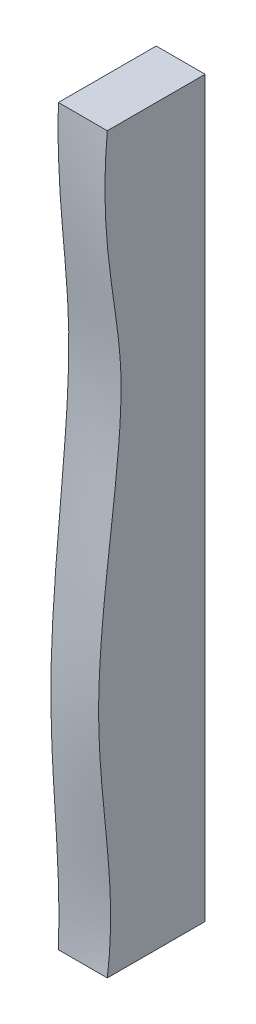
ISO-10303-21;
HEADER;
FILE_DESCRIPTION(('STEP AP214'),'2;1');
FILE_NAME('part.step','',(''),(''),'','','');
FILE_SCHEMA(('AUTOMOTIVE_DESIGN { 1 0 10303 214 1 1 1 1 }'));
ENDSEC;
DATA;
#1=APPLICATION_CONTEXT('core data for automotive mechanical design processes');
#2=APPLICATION_PROTOCOL_DEFINITION('international standard','automotive_design',2000,#1);
#3=PRODUCT_CONTEXT('',#1,'mechanical');
#4=PRODUCT('Part','Part','',(#3));
#5=PRODUCT_RELATED_PRODUCT_CATEGORY('part','',(#4));
#6=PRODUCT_DEFINITION_FORMATION('','',#4);
#7=PRODUCT_DEFINITION_CONTEXT('part definition',#1,'design');
#8=PRODUCT_DEFINITION('design','',#6,#7);
#9=PRODUCT_DEFINITION_SHAPE('','',#8);
#10=(LENGTH_UNIT() NAMED_UNIT(*) SI_UNIT(.MILLI.,.METRE.));
#11=(NAMED_UNIT(*) PLANE_ANGLE_UNIT() SI_UNIT($,.RADIAN.));
#12=(NAMED_UNIT(*) SI_UNIT($,.STERADIAN.) SOLID_ANGLE_UNIT());
#13=UNCERTAINTY_MEASURE_WITH_UNIT(LENGTH_MEASURE(1.E-05),#10,'distance_accuracy_value','');
#14=(GEOMETRIC_REPRESENTATION_CONTEXT(3) GLOBAL_UNCERTAINTY_ASSIGNED_CONTEXT((#13)) GLOBAL_UNIT_ASSIGNED_CONTEXT((#10,
#11,#12)) REPRESENTATION_CONTEXT('',''));
#15=CARTESIAN_POINT('',(0.,0.,0.));
#16=DIRECTION('',(0.,0.,1.));
#17=DIRECTION('',(1.,0.,0.));
#18=AXIS2_PLACEMENT_3D('',#15,#16,#17);
#19=CARTESIAN_POINT('',(-750.,-375.,253.111113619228));
#20=DIRECTION('',(0.,1.,0.));
#21=DIRECTION('',(0.,0.,1.));
#22=AXIS2_PLACEMENT_3D('',#19,#20,#21);
#23=PLANE('',#22);
#24=DIRECTION('',(0.,0.,-1.));
#25=VECTOR('',#24,1.);
#26=CARTESIAN_POINT('',(-650.,-375.,253.120113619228));
#27=LINE('',#26,#25);
#28=CARTESIAN_POINT('',(-650.,-375.,100.));
#29=VERTEX_POINT('',#28);
#30=CARTESIAN_POINT('',(-650.,-375.,0.));
#31=VERTEX_POINT('',#30);
#32=EDGE_CURVE('E11',#29,#31,#27,.T.);
#33=ORIENTED_EDGE('',*,*,#32,.F.);
#34=CARTESIAN_POINT('',(-750.,-375.,100.));
#35=CARTESIAN_POINT('',(-644.685568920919,-375.,100.));
#36=CARTESIAN_POINT('',(-536.684515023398,-375.,100.));
#37=CARTESIAN_POINT('',(-355.235514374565,-375.,100.));
#38=CARTESIAN_POINT('',(-175.903454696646,-375.,100.));
#39=CARTESIAN_POINT('',(47.4554331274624,-375.,100.));
#40=CARTESIAN_POINT('',(285.091607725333,-375.,100.));
#41=CARTESIAN_POINT('',(500.445116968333,-375.,100.));
#42=CARTESIAN_POINT('',(669.085175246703,-375.,100.));
#43=CARTESIAN_POINT('',(750.,-375.,100.));
#44=B_SPLINE_CURVE_WITH_KNOTS('',3,(#34,#35,#36,#37,#38,#39,#40,#41,#42,#43),.UNSPECIFIED.,.F.,
.F.,(4,1,1,1,1,1,1,4),(0.,0.210628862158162,0.216002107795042,0.362898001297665,0.569292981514,
0.66271988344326,0.838170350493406,1.),.UNSPECIFIED.);
#45=CARTESIAN_POINT('',(-700.,-375.,100.));
#46=VERTEX_POINT('',#45);
#47=EDGE_CURVE('E165',#46,#29,#44,.T.);
#48=ORIENTED_EDGE('',*,*,#47,.F.);
#49=DIRECTION('',(0.,0.,-1.));
#50=VECTOR('',#49,1.);
#51=CARTESIAN_POINT('',(-700.,-375.,253.120113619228));
#52=LINE('',#51,#50);
#53=CARTESIAN_POINT('',(-700.,-375.,0.));
#54=VERTEX_POINT('',#53);
#55=EDGE_CURVE('E89',#46,#54,#52,.T.);
#56=ORIENTED_EDGE('',*,*,#55,.T.);
#57=DIRECTION('',(1.,0.,0.));
#58=VECTOR('',#57,1.);
#59=CARTESIAN_POINT('',(-750.,-375.,0.));
#60=LINE('',#59,#58);
#61=EDGE_CURVE('E84',#54,#31,#60,.T.);
#62=ORIENTED_EDGE('',*,*,#61,.T.);
#63=EDGE_LOOP('',(#33,#48,#56,#62));
#64=FACE_BOUND('',#63,.T.);
#65=ADVANCED_FACE('F35',(#64),#23,.F.);
#66=CARTESIAN_POINT('',(-750.,375.,253.111113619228));
#67=DIRECTION('',(0.,-1.,0.));
#68=DIRECTION('',(0.,0.,-1.));
#69=AXIS2_PLACEMENT_3D('',#66,#67,#68);
#70=PLANE('',#69);
#71=DIRECTION('',(0.,0.,-1.));
#72=VECTOR('',#71,1.);
#73=CARTESIAN_POINT('',(-650.,375.,253.120113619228));
#74=LINE('',#73,#72);
#75=CARTESIAN_POINT('',(-650.,375.,100.));
#76=VERTEX_POINT('',#75);
#77=CARTESIAN_POINT('',(-650.,375.,0.));
#78=VERTEX_POINT('',#77);
#79=EDGE_CURVE('E54',#76,#78,#74,.T.);
#80=ORIENTED_EDGE('',*,*,#79,.T.);
#81=DIRECTION('',(-1.,0.,0.));
#82=VECTOR('',#81,1.);
#83=CARTESIAN_POINT('',(-750.,375.,0.));
#84=LINE('',#83,#82);
#85=CARTESIAN_POINT('',(-700.,375.,0.));
#86=VERTEX_POINT('',#85);
#87=EDGE_CURVE('E85',#78,#86,#84,.T.);
#88=ORIENTED_EDGE('',*,*,#87,.T.);
#89=DIRECTION('',(0.,0.,-1.));
#90=VECTOR('',#89,1.);
#91=CARTESIAN_POINT('',(-700.,375.,253.120113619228));
#92=LINE('',#91,#90);
#93=CARTESIAN_POINT('',(-700.,375.,100.));
#94=VERTEX_POINT('',#93);
#95=EDGE_CURVE('E162',#94,#86,#92,.T.);
#96=ORIENTED_EDGE('',*,*,#95,.F.);
#97=CARTESIAN_POINT('',(750.,375.,100.));
#98=CARTESIAN_POINT('',(669.085175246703,375.,100.));
#99=CARTESIAN_POINT('',(500.445116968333,375.,100.));
#100=CARTESIAN_POINT('',(285.091607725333,375.,100.));
#101=CARTESIAN_POINT('',(47.4554331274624,375.,100.));
#102=CARTESIAN_POINT('',(-175.903454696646,375.,100.));
#103=CARTESIAN_POINT('',(-355.235514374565,375.,100.));
#104=CARTESIAN_POINT('',(-536.684515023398,375.,100.));
#105=CARTESIAN_POINT('',(-644.685568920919,375.,100.));
#106=CARTESIAN_POINT('',(-750.,375.,100.));
#107=B_SPLINE_CURVE_WITH_KNOTS('',3,(#97,#98,#99,#100,#101,#102,#103,#104,#105,#106),
.UNSPECIFIED.,.F.,.F.,(4,1,1,1,1,1,1,4),(0.,0.161829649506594,0.33728011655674,0.430707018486,
0.637101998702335,0.783997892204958,0.789371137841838,1.),.UNSPECIFIED.);
#108=EDGE_CURVE('E161',#76,#94,#107,.T.);
#109=ORIENTED_EDGE('',*,*,#108,.F.);
#110=EDGE_LOOP('',(#80,#88,#96,#109));
#111=FACE_BOUND('',#110,.T.);
#112=ADVANCED_FACE('F116',(#111),#70,.F.);
#113=CARTESIAN_POINT('',(0.,0.,0.));
#114=DIRECTION('',(0.,0.,-1.));
#115=DIRECTION('',(-1.,0.,0.));
#116=AXIS2_PLACEMENT_3D('',#113,#114,#115);
#117=PLANE('',#116);
#118=ORIENTED_EDGE('',*,*,#87,.F.);
#119=DIRECTION('',(0.,-1.,0.));
#120=VECTOR('',#119,1.);
#121=CARTESIAN_POINT('',(-650.,375.,0.));
#122=LINE('',#121,#120);
#123=EDGE_CURVE('E74',#78,#31,#122,.T.);
#124=ORIENTED_EDGE('',*,*,#123,.T.);
#125=ORIENTED_EDGE('',*,*,#61,.F.);
#126=DIRECTION('',(0.,1.,0.));
#127=VECTOR('',#126,1.);
#128=CARTESIAN_POINT('',(-700.,375.,0.));
#129=LINE('',#128,#127);
#130=EDGE_CURVE('E86',#54,#86,#129,.T.);
#131=ORIENTED_EDGE('',*,*,#130,.T.);
#132=EDGE_LOOP('',(#118,#124,#125,#131));
#133=FACE_BOUND('',#132,.T.);
#134=ADVANCED_FACE('F82',(#133),#117,.T.);
#135=CARTESIAN_POINT('',(750.,-375.,100.));
#136=CARTESIAN_POINT('',(750.,-302.078506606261,100.));
#137=CARTESIAN_POINT('',(750.,-224.483786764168,100.));
#138=CARTESIAN_POINT('',(750.,-61.5160152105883,100.));
#139=CARTESIAN_POINT('',(750.,39.4445673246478,100.));
#140=CARTESIAN_POINT('',(750.,211.849847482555,100.));
#141=CARTESIAN_POINT('',(750.,298.882075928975,100.));
#142=CARTESIAN_POINT('',(750.,375.,100.));
#143=CARTESIAN_POINT('',(669.085175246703,-375.,100.));
#144=CARTESIAN_POINT('',(669.085175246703,-302.078506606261,100.));
#145=CARTESIAN_POINT('',(669.085175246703,-234.282472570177,121.198481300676));
#146=CARTESIAN_POINT('',(669.085175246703,-62.2283080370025,120.288550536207));
#147=CARTESIAN_POINT('',(669.085175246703,68.0647781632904,82.7868169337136));
#148=CARTESIAN_POINT('',(669.085175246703,240.312514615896,73.0426687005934));
#149=CARTESIAN_POINT('',(669.085175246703,298.882075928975,100.));
#150=CARTESIAN_POINT('',(669.085175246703,375.,100.));
#151=CARTESIAN_POINT('',(500.445116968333,-375.,100.));
#152=CARTESIAN_POINT('',(517.991528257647,-284.627602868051,95.5040591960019));
#153=CARTESIAN_POINT('',(530.038001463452,-221.673003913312,150.719602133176));
#154=CARTESIAN_POINT('',(473.74510655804,-71.7416270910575,167.060530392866));
#155=CARTESIAN_POINT('',(387.213321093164,45.6135081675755,91.591323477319));
#156=CARTESIAN_POINT('',(378.694107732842,207.638743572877,66.6461848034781));
#157=CARTESIAN_POINT('',(433.17831170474,253.396603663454,122.492891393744));
#158=CARTESIAN_POINT('',(500.445116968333,375.,100.));
#159=CARTESIAN_POINT('',(285.091607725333,-375.,100.));
#160=CARTESIAN_POINT('',(309.270321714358,-264.297524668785,86.4064578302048));
#161=CARTESIAN_POINT('',(325.856840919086,-200.08226970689,164.07204721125));
#162=CARTESIAN_POINT('',(247.47112957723,-80.9425320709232,234.992870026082));
#163=CARTESIAN_POINT('',(127.240382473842,2.40271344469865,186.756001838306));
#164=CARTESIAN_POINT('',(115.567806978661,152.518027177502,151.057444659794));
#165=CARTESIAN_POINT('',(191.428893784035,202.025100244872,189.039851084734));
#166=CARTESIAN_POINT('',(285.091607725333,375.,100.));
#167=CARTESIAN_POINT('',(47.4554331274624,-375.,100.));
#168=CARTESIAN_POINT('',(51.0669239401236,-278.639867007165,99.5141662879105));
#169=CARTESIAN_POINT('',(52.9210710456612,-231.452124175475,201.325948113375));
#170=CARTESIAN_POINT('',(3.18149891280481,-90.8615864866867,272.445475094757));
#171=CARTESIAN_POINT('',(-61.0346058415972,45.7948958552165,186.157760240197));
#172=CARTESIAN_POINT('',(-59.6612105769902,205.286893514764,133.941969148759));
#173=CARTESIAN_POINT('',(-11.8049718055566,220.40073671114,189.8209162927));
#174=CARTESIAN_POINT('',(47.4554331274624,375.,100.));
#175=CARTESIAN_POINT('',(-175.903454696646,-375.,100.));
#176=CARTESIAN_POINT('',(-199.823715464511,-320.588060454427,126.731848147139));
#177=CARTESIAN_POINT('',(-216.967937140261,-300.821135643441,242.921959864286));
#178=CARTESIAN_POINT('',(-184.265304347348,-55.1410097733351,206.147478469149));
#179=CARTESIAN_POINT('',(-119.865061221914,249.096629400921,-32.5779079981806));
#180=CARTESIAN_POINT('',(-104.641938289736,431.262460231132,-94.4845569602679));
#181=CARTESIAN_POINT('',(-136.623034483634,348.137040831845,60.785640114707));
#182=CARTESIAN_POINT('',(-175.903454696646,375.,100.));
#183=CARTESIAN_POINT('',(-355.235514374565,-375.,100.));
#184=CARTESIAN_POINT('',(-319.200833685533,-282.590755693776,58.2859511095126));
#185=CARTESIAN_POINT('',(-293.075279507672,-226.888141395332,104.97090627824));
#186=CARTESIAN_POINT('',(-324.119079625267,-68.6572837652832,122.102733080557));
#187=CARTESIAN_POINT('',(-398.972481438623,73.039345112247,53.3701087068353));
#188=CARTESIAN_POINT('',(-423.398679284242,233.384819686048,47.4380317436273));
#189=CARTESIAN_POINT('',(-392.720188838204,253.575952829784,124.952096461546));
#190=CARTESIAN_POINT('',(-355.235514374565,375.,100.));
#191=CARTESIAN_POINT('',(-536.684515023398,-375.,100.));
#192=CARTESIAN_POINT('',(-494.827225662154,-277.129657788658,52.0422385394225));
#193=CARTESIAN_POINT('',(-464.573647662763,-205.017596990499,67.039018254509));
#194=CARTESIAN_POINT('',(-506.334367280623,-72.2467511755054,96.5036749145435));
#195=CARTESIAN_POINT('',(-600.216684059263,9.35641022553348,95.9941925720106));
#196=CARTESIAN_POINT('',(-628.122542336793,166.946160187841,106.349064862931));
#197=CARTESIAN_POINT('',(-587.011939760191,237.095914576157,138.331902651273));
#198=CARTESIAN_POINT('',(-536.684515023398,375.,100.));
#199=CARTESIAN_POINT('',(-644.685568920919,-375.,100.));
#200=CARTESIAN_POINT('',(-644.685568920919,-302.078506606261,100.));
#201=CARTESIAN_POINT('',(-644.685568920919,-237.237234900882,127.59081546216));
#202=CARTESIAN_POINT('',(-644.685568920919,-62.4430976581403,126.406497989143));
#203=CARTESIAN_POINT('',(-644.685568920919,76.6951111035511,77.5962366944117));
#204=CARTESIAN_POINT('',(-644.685568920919,248.895340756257,64.9137717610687));
#205=CARTESIAN_POINT('',(-644.685568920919,298.882075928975,100.));
#206=CARTESIAN_POINT('',(-644.685568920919,375.,100.));
#207=CARTESIAN_POINT('',(-750.,-375.,100.));
#208=CARTESIAN_POINT('',(-750.,-302.078506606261,100.));
#209=CARTESIAN_POINT('',(-750.,-224.483786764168,100.));
#210=CARTESIAN_POINT('',(-750.,-61.5160152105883,100.));
#211=CARTESIAN_POINT('',(-750.,39.4445673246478,100.));
#212=CARTESIAN_POINT('',(-750.,211.849847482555,100.));
#213=CARTESIAN_POINT('',(-750.,298.882075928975,100.));
#214=CARTESIAN_POINT('',(-750.,375.,100.));
#215=B_SPLINE_SURFACE_WITH_KNOTS('',3,3,((#135,#136,#137,#138,#139,#140,#141,#142),(#143,#144,
#145,#146,#147,#148,#149,#150),(#151,#152,#153,#154,#155,#156,#157,#158),(#159,#160,#161,#162,
#163,#164,#165,#166),(#167,#168,#169,#170,#171,#172,#173,#174),(#175,#176,#177,#178,#179,#180,
#181,#182),(#183,#184,#185,#186,#187,#188,#189,#190),(#191,#192,#193,#194,#195,#196,#197,#198),
(#199,#200,#201,#202,#203,#204,#205,#206),(#207,#208,#209,#210,#211,#212,#213,#214)),
.UNSPECIFIED.,.F.,.F.,.F.,(4,1,1,1,1,1,1,4),(4,1,1,1,1,4),(0.,0.161829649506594,
0.33728011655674,0.430707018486,0.637101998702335,0.783997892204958,0.789371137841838,1.),(0.,
0.291685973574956,0.310378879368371,0.65187108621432,0.695528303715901,1.),.UNSPECIFIED.);
#216=CARTESIAN_POINT('',(-650.,375.,100.));
#217=CARTESIAN_POINT('',(-650.,372.29131660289,100.259982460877));
#218=CARTESIAN_POINT('',(-650.,369.580709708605,100.500061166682));
#219=CARTESIAN_POINT('',(-650.,364.156408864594,100.939560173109));
#220=CARTESIAN_POINT('',(-650.,361.442715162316,101.138983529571));
#221=CARTESIAN_POINT('',(-650.,356.0127964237,101.496346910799));
#222=CARTESIAN_POINT('',(-650.,353.296571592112,101.654290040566));
#223=CARTESIAN_POINT('',(-650.,347.862165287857,101.928024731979));
#224=CARTESIAN_POINT('',(-650.,345.143983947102,102.043818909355));
#225=CARTESIAN_POINT('',(-650.,339.706244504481,102.232738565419));
#226=CARTESIAN_POINT('',(-650.,336.986686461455,102.305865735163));
#227=CARTESIAN_POINT('',(-650.,331.546784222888,102.409127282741));
#228=CARTESIAN_POINT('',(-650.,328.826440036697,102.439262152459));
#229=CARTESIAN_POINT('',(-650.,323.398434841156,102.456403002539));
#230=CARTESIAN_POINT('',(-650.,320.690774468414,102.443611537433));
#231=CARTESIAN_POINT('',(-650.,315.276004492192,102.375521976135));
#232=CARTESIAN_POINT('',(-650.,312.568894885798,102.32022411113));
#233=CARTESIAN_POINT('',(-650.,307.155870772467,102.167615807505));
#234=CARTESIAN_POINT('',(-650.,304.449956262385,102.070305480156));
#235=CARTESIAN_POINT('',(-650.,299.039950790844,101.834532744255));
#236=CARTESIAN_POINT('',(-650.,296.335859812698,101.696070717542));
#237=CARTESIAN_POINT('',(-650.,290.930113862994,101.379278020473));
#238=CARTESIAN_POINT('',(-650.,288.228458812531,101.200948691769));
#239=CARTESIAN_POINT('',(-650.,282.828170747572,100.806180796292));
#240=CARTESIAN_POINT('',(-650.,280.129537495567,100.58974547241));
#241=CARTESIAN_POINT('',(-650.,275.414941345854,100.180089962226));
#242=CARTESIAN_POINT('',(-650.,273.398287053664,99.9947599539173));
#243=CARTESIAN_POINT('',(-650.,269.36690755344,99.6052325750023));
#244=CARTESIAN_POINT('',(-650.,267.352182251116,99.4010361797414));
#245=CARTESIAN_POINT('',(-650.,263.324634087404,98.9751303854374));
#246=CARTESIAN_POINT('',(-650.,261.311811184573,98.7534213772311));
#247=CARTESIAN_POINT('',(-650.,257.288013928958,98.2940565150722));
#248=CARTESIAN_POINT('',(-650.,255.277039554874,98.0564008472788));
#249=CARTESIAN_POINT('',(-650.,251.25609579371,97.5668374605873));
#250=CARTESIAN_POINT('',(-650.,249.246127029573,97.3149246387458));
#251=CARTESIAN_POINT('',(-650.,245.227745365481,96.7989396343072));
#252=CARTESIAN_POINT('',(-650.,243.219332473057,96.5348673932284));
#253=CARTESIAN_POINT('',(-650.,239.203816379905,95.9968139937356));
#254=CARTESIAN_POINT('',(-650.,237.196713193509,95.7228327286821));
#255=CARTESIAN_POINT('',(-650.,233.183537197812,95.1674572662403));
#256=CARTESIAN_POINT('',(-650.,231.177464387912,94.8860630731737));
#257=CARTESIAN_POINT('',(-650.,227.167507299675,94.318811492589));
#258=CARTESIAN_POINT('',(-650.,225.163622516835,94.0329576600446));
#259=CARTESIAN_POINT('',(-650.,221.156113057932,93.4595443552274));
#260=CARTESIAN_POINT('',(-650.,219.152488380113,93.1719848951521));
#261=CARTESIAN_POINT('',(-650.,215.145205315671,92.5983697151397));
#262=CARTESIAN_POINT('',(-650.,213.141546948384,92.3123138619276));
#263=CARTESIAN_POINT('',(-650.,209.133541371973,91.7450741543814));
#264=CARTESIAN_POINT('',(-650.,207.129194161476,91.4638903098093));
#265=CARTESIAN_POINT('',(-650.,201.113782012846,90.6328786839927));
#266=CARTESIAN_POINT('',(-650.,197.100922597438,90.0956753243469));
#267=CARTESIAN_POINT('',(-650.,191.075501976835,89.3375107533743));
#268=CARTESIAN_POINT('',(-650.,189.065951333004,89.0927232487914));
#269=CARTESIAN_POINT('',(-650.,185.044539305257,88.6228341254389));
#270=CARTESIAN_POINT('',(-650.,183.032677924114,88.3977324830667));
#271=CARTESIAN_POINT('',(-650.,179.005657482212,87.9708421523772));
#272=CARTESIAN_POINT('',(-650.,176.990497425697,87.7690628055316));
#273=CARTESIAN_POINT('',(-650.,172.95763487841,87.39249260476));
#274=CARTESIAN_POINT('',(-650.,170.939932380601,87.2177018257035));
#275=CARTESIAN_POINT('',(-650.,166.902229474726,86.8984497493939));
#276=CARTESIAN_POINT('',(-650.,164.882229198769,86.7539867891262));
#277=CARTESIAN_POINT('',(-650.,160.840105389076,86.4983871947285));
#278=CARTESIAN_POINT('',(-650.,158.817981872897,86.3872502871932));
#279=CARTESIAN_POINT('',(-650.,156.120512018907,86.2630069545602));
#280=CARTESIAN_POINT('',(-650.,155.445878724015,86.2339352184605));
#281=CARTESIAN_POINT('',(-650.,154.096448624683,86.1798641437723));
#282=CARTESIAN_POINT('',(-650.,153.421651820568,86.1548647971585));
#283=CARTESIAN_POINT('',(-650.,152.071913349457,86.1090327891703));
#284=CARTESIAN_POINT('',(-650.,151.396971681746,86.0882001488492));
#285=CARTESIAN_POINT('',(-650.,150.046972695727,86.0507153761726));
#286=CARTESIAN_POINT('',(-650.,149.371915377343,86.0340632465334));
#287=CARTESIAN_POINT('',(-650.,147.346618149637,85.9901308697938));
#288=CARTESIAN_POINT('',(-650.,145.996243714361,85.9688743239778));
#289=CARTESIAN_POINT('',(-650.,143.295505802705,85.9413333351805));
#290=CARTESIAN_POINT('',(-650.,141.945142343,85.9350471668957));
#291=CARTESIAN_POINT('',(-650.,139.244421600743,85.9363774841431));
#292=CARTESIAN_POINT('',(-650.,137.894064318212,85.9439940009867));
#293=CARTESIAN_POINT('',(-650.,135.1934889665,85.972116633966));
#294=CARTESIAN_POINT('',(-650.,133.843270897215,85.9926227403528));
#295=CARTESIAN_POINT('',(-650.,130.871758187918,86.0508713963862));
#296=CARTESIAN_POINT('',(-650.,129.250515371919,86.0912496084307));
#297=CARTESIAN_POINT('',(-650.,126.008482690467,86.1875922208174));
#298=CARTESIAN_POINT('',(-650.,124.387692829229,86.2435567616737));
#299=CARTESIAN_POINT('',(-650.,121.956845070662,86.3380607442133));
#300=CARTESIAN_POINT('',(-650.,121.146577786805,86.3713235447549));
#301=CARTESIAN_POINT('',(-650.,119.526186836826,86.4411827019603));
#302=CARTESIAN_POINT('',(-650.,118.716063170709,86.4777790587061));
#303=CARTESIAN_POINT('',(-650.,116.285926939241,86.5924121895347));
#304=CARTESIAN_POINT('',(-650.,114.666140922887,86.6752933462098));
#305=CARTESIAN_POINT('',(-650.,111.426985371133,86.8532037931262));
#306=CARTESIAN_POINT('',(-650.,109.807615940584,86.9482349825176));
#307=CARTESIAN_POINT('',(-650.,106.569585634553,87.1496532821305));
#308=CARTESIAN_POINT('',(-650.,104.950924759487,87.2560403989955));
#309=CARTESIAN_POINT('',(-650.,100.095710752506,87.5910964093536));
#310=CARTESIAN_POINT('',(-650.,96.8602456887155,87.8356421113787));
#311=CARTESIAN_POINT('',(-650.,90.3923648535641,88.3610315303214));
#312=CARTESIAN_POINT('',(-650.,87.1599490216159,88.6418745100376));
#313=CARTESIAN_POINT('',(-650.,80.6928815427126,89.2345803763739));
#314=CARTESIAN_POINT('',(-650.,77.4582342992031,89.5464910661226));
#315=CARTESIAN_POINT('',(-650.,70.991891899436,90.1954789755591));
#316=CARTESIAN_POINT('',(-650.,67.7601964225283,90.5325530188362));
#317=CARTESIAN_POINT('',(-650.,61.2991748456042,91.2267916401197));
#318=CARTESIAN_POINT('',(-650.,58.0698486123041,91.5839549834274));
#319=CARTESIAN_POINT('',(-650.,51.613023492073,92.3136478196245));
#320=CARTESIAN_POINT('',(-650.,48.3855245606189,92.6861769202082));
#321=CARTESIAN_POINT('',(-650.,41.9318488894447,93.4422112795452));
#322=CARTESIAN_POINT('',(-650.,38.705672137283,93.8257164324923));
#323=CARTESIAN_POINT('',(-650.,32.657005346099,94.5512989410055));
#324=CARTESIAN_POINT('',(-650.,29.8344180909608,94.8925686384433));
#325=CARTESIAN_POINT('',(-650.,24.1895746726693,95.5778386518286));
#326=CARTESIAN_POINT('',(-650.,21.3673185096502,95.9218389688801));
#327=CARTESIAN_POINT('',(-650.,12.900634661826,96.9542685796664));
#328=CARTESIAN_POINT('',(-650.,7.25625939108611,97.6431304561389));
#329=CARTESIAN_POINT('',(-650.,-4.03454214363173,99.0040453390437));
#330=CARTESIAN_POINT('',(-650.,-9.68096841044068,99.6760983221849));
#331=CARTESIAN_POINT('',(-650.,-20.9779293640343,100.986865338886));
#332=CARTESIAN_POINT('',(-650.,-26.6284641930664,101.625578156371));
#333=CARTESIAN_POINT('',(-650.,-37.9356219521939,102.853861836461));
#334=CARTESIAN_POINT('',(-650.,-43.5922455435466,103.443426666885));
#335=CARTESIAN_POINT('',(-650.,-54.9135290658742,104.557768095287));
#336=CARTESIAN_POINT('',(-650.,-60.5781908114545,105.082526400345));
#337=CARTESIAN_POINT('',(-650.,-71.9123805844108,106.050739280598));
#338=CARTESIAN_POINT('',(-650.,-77.5819058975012,106.494225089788));
#339=CARTESIAN_POINT('',(-650.,-86.0918232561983,107.085792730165));
#340=CARTESIAN_POINT('',(-650.,-88.9296724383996,107.270719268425));
#341=CARTESIAN_POINT('',(-650.,-94.6070048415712,107.613686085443));
#342=CARTESIAN_POINT('',(-650.,-97.4464880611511,107.771726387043));
#343=CARTESIAN_POINT('',(-650.,-103.126388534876,108.058478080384));
#344=CARTESIAN_POINT('',(-650.,-105.966805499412,108.187195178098));
#345=CARTESIAN_POINT('',(-650.,-111.64891886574,108.412770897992));
#346=CARTESIAN_POINT('',(-650.,-114.490615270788,108.509629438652));
#347=CARTESIAN_POINT('',(-650.,-120.173974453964,108.668717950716));
#348=CARTESIAN_POINT('',(-650.,-123.015636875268,108.730960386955));
#349=CARTESIAN_POINT('',(-650.,-127.278542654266,108.79617813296));
#350=CARTESIAN_POINT('',(-650.,-128.69958046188,108.813226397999));
#351=CARTESIAN_POINT('',(-650.,-131.541743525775,108.837548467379));
#352=CARTESIAN_POINT('',(-650.,-132.962868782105,108.844822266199));
#353=CARTESIAN_POINT('',(-650.,-135.804799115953,108.849188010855));
#354=CARTESIAN_POINT('',(-650.,-137.225604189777,108.846282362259));
#355=CARTESIAN_POINT('',(-650.,-140.067153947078,108.829877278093));
#356=CARTESIAN_POINT('',(-650.,-141.487898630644,108.816377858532));
#357=CARTESIAN_POINT('',(-650.,-143.618901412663,108.787836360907));
#358=CARTESIAN_POINT('',(-650.,-144.329216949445,108.776940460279));
#359=CARTESIAN_POINT('',(-650.,-145.74979973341,108.752356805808));
#360=CARTESIAN_POINT('',(-650.,-146.460066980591,108.738669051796));
#361=CARTESIAN_POINT('',(-650.,-148.590783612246,108.693562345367));
#362=CARTESIAN_POINT('',(-650.,-150.011149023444,108.658099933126));
#363=CARTESIAN_POINT('',(-650.,-152.851450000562,108.577055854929));
#364=CARTESIAN_POINT('',(-650.,-154.271385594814,108.53147517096));
#365=CARTESIAN_POINT('',(-650.,-157.110922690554,108.430908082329));
#366=CARTESIAN_POINT('',(-650.,-158.530524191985,108.375921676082));
#367=CARTESIAN_POINT('',(-650.,-161.369367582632,108.257163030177));
#368=CARTESIAN_POINT('',(-650.,-162.788609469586,108.193390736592));
#369=CARTESIAN_POINT('',(-650.,-165.626690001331,108.057478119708));
#370=CARTESIAN_POINT('',(-650.,-167.045528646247,107.985337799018));
#371=CARTESIAN_POINT('',(-650.,-171.330295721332,107.755503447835));
#372=CARTESIAN_POINT('',(-650.,-174.195576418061,107.585621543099));
#373=CARTESIAN_POINT('',(-650.,-179.9242776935,107.21741325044));
#374=CARTESIAN_POINT('',(-650.,-182.787698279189,107.019086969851));
#375=CARTESIAN_POINT('',(-650.,-188.513693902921,106.597904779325));
#376=CARTESIAN_POINT('',(-650.,-191.376268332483,106.375040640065));
#377=CARTESIAN_POINT('',(-650.,-197.09975349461,105.908958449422));
#378=CARTESIAN_POINT('',(-650.,-199.960664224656,105.665740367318));
#379=CARTESIAN_POINT('',(-650.,-205.681942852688,105.163127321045));
#380=CARTESIAN_POINT('',(-650.,-208.542310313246,104.903727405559));
#381=CARTESIAN_POINT('',(-650.,-214.261950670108,104.373206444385));
#382=CARTESIAN_POINT('',(-650.,-217.12122356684,104.102085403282));
#383=CARTESIAN_POINT('',(-650.,-222.839303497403,103.552614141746));
#384=CARTESIAN_POINT('',(-650.,-225.698110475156,103.274263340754));
#385=CARTESIAN_POINT('',(-650.,-231.415474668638,102.715002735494));
#386=CARTESIAN_POINT('',(-650.,-234.274031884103,102.434092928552));
#387=CARTESIAN_POINT('',(-650.,-242.848637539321,101.594773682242));
#388=CARTESIAN_POINT('',(-650.,-248.565013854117,101.039635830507));
#389=CARTESIAN_POINT('',(-650.,-259.999281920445,99.9778230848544));
#390=CARTESIAN_POINT('',(-650.,-265.717171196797,99.4711222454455));
#391=CARTESIAN_POINT('',(-650.,-277.167487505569,98.5463275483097));
#392=CARTESIAN_POINT('',(-650.,-282.899923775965,98.1283452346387));
#393=CARTESIAN_POINT('',(-650.,-294.370991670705,97.4242019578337));
#394=CARTESIAN_POINT('',(-650.,-300.10961980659,97.1379872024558));
#395=CARTESIAN_POINT('',(-650.,-308.723038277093,96.8389783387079));
#396=CARTESIAN_POINT('',(-650.,-311.595593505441,96.7610253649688));
#397=CARTESIAN_POINT('',(-650.,-317.341647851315,96.6537483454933));
#398=CARTESIAN_POINT('',(-650.,-320.215146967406,96.6244242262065));
#399=CARTESIAN_POINT('',(-650.,-325.967155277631,96.6194201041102));
#400=CARTESIAN_POINT('',(-650.,-328.845664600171,96.643832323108));
#401=CARTESIAN_POINT('',(-650.,-334.601579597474,96.751306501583));
#402=CARTESIAN_POINT('',(-650.,-337.478985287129,96.8343676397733));
#403=CARTESIAN_POINT('',(-650.,-343.242468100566,97.0641069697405));
#404=CARTESIAN_POINT('',(-650.,-346.12853557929,97.2110306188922));
#405=CARTESIAN_POINT('',(-650.,-351.896372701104,97.5727305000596));
#406=CARTESIAN_POINT('',(-650.,-354.778142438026,97.7875052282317));
#407=CARTESIAN_POINT('',(-650.,-360.555038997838,98.290353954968));
#408=CARTESIAN_POINT('',(-650.,-363.450123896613,98.5789150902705));
#409=CARTESIAN_POINT('',(-650.,-367.786399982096,99.0686324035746));
#410=CARTESIAN_POINT('',(-650.,-369.230845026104,99.2413616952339));
#411=CARTESIAN_POINT('',(-650.,-372.117311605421,99.6061205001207));
#412=CARTESIAN_POINT('',(-650.,-373.55933311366,99.7981502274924));
#413=CARTESIAN_POINT('',(-650.,-375.,100.));
#414=B_SPLINE_CURVE_WITH_KNOTS('',3,(#216,#217,#218,#219,#220,#221,#222,#223,#224,#225,#226,
#227,#228,#229,#230,#231,#232,#233,#234,#235,#236,#237,#238,#239,#240,#241,#242,#243,#244,#245,
#246,#247,#248,#249,#250,#251,#252,#253,#254,#255,#256,#257,#258,#259,#260,#261,#262,#263,#264,
#265,#266,#267,#268,#269,#270,#271,#272,#273,#274,#275,#276,#277,#278,#279,#280,#281,#282,#283,
#284,#285,#286,#287,#288,#289,#290,#291,#292,#293,#294,#295,#296,#297,#298,#299,#300,#301,#302,
#303,#304,#305,#306,#307,#308,#309,#310,#311,#312,#313,#314,#315,#316,#317,#318,#319,#320,#321,
#322,#323,#324,#325,#326,#327,#328,#329,#330,#331,#332,#333,#334,#335,#336,#337,#338,#339,#340,
#341,#342,#343,#344,#345,#346,#347,#348,#349,#350,#351,#352,#353,#354,#355,#356,#357,#358,#359,
#360,#361,#362,#363,#364,#365,#366,#367,#368,#369,#370,#371,#372,#373,#374,#375,#376,#377,#378,
#379,#380,#381,#382,#383,#384,#385,#386,#387,#388,#389,#390,#391,#392,#393,#394,#395,#396,#397,
#398,#399,#400,#401,#402,#403,#404,#405,#406,#407,#408,#409,#410,#411,#412,#413),.UNSPECIFIED.,
.F.,.F.,(4,2,2,2,2,2,2,2,2,2,2,2,2,2,2,2,2,2,2,2,2,2,2,2,2,2,2,2,2,2,2,2,2,2,2,2,2,2,2,2,2,2,2,
2,2,2,2,2,2,2,2,2,2,2,2,2,2,2,2,2,2,2,2,2,2,2,2,2,2,2,2,2,2,2,2,2,2,2,2,2,2,2,2,2,2,2,2,2,2,2,2,
2,2,2,2,2,2,2,4),(0.,8.16334035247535,16.3260668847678,24.4881822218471,32.6497909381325,
40.8110761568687,48.972267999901,57.0950042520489,65.21769632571,73.3403668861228,
81.4629620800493,89.5852839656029,97.7069149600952,103.782284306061,109.857339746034,
115.93225964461,122.007108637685,128.084145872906,134.161212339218,140.238344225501,
146.315472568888,152.387981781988,158.460447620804,164.532365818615,170.604296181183,
182.749903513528,188.823040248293,194.896169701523,200.971723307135,207.047293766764,
213.122530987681,219.19771836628,221.223488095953,223.249253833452,225.275029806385,
227.300807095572,231.352333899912,235.403393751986,239.45446272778,243.5055286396,
248.370680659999,253.235876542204,255.668719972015,258.101563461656,262.967225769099,
267.833649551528,272.700076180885,282.433889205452,292.167504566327,301.916335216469,
311.663937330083,321.410941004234,331.15769597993,340.90435703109,349.43378457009,
357.963215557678,375.021980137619,392.080768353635,409.140178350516,426.201679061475,
443.267984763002,460.327717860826,468.859217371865,477.390709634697,485.920540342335,
494.450392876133,502.977171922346,507.240564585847,511.503959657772,515.766347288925,
520.028728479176,522.159920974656,524.291113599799,528.553495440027,532.815463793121,
537.077432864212,541.339428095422,545.601421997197,554.212179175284,562.822903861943,
571.436525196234,580.050159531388,588.666442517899,597.28272213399,605.899695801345,
614.516678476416,631.746441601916,648.966923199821,666.208929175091,683.443890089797,
692.064387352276,700.684871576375,709.320161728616,717.955330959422,726.623987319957,
735.292451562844,744.019692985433,748.383787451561,752.747930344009),.UNSPECIFIED.);
#415=EDGE_CURVE('E46',#76,#29,#414,.T.);
#416=CARTESIAN_POINT('',(-700.,-375.,100.));
#417=CARTESIAN_POINT('',(-700.,-371.645967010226,99.8589814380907));
#418=CARTESIAN_POINT('',(-700.,-368.290848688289,99.7454685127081));
#419=CARTESIAN_POINT('',(-700.,-361.579429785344,99.5693154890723));
#420=CARTESIAN_POINT('',(-700.,-358.223129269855,99.5066729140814));
#421=CARTESIAN_POINT('',(-700.,-351.511077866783,99.4281217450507));
#422=CARTESIAN_POINT('',(-700.,-348.155327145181,99.4121982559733));
#423=CARTESIAN_POINT('',(-700.,-341.44387299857,99.4227138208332));
#424=CARTESIAN_POINT('',(-700.,-338.088169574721,99.4491534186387));
#425=CARTESIAN_POINT('',(-700.,-328.031532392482,99.585285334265));
#426=CARTESIAN_POINT('',(-700.,-321.331348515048,99.7517025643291));
#427=CARTESIAN_POINT('',(-700.,-307.934550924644,100.200187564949));
#428=CARTESIAN_POINT('',(-699.999999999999,-301.237937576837,100.482265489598));
#429=CARTESIAN_POINT('',(-699.999999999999,-290.085125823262,101.018681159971));
#430=CARTESIAN_POINT('',(-700.,-285.627821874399,101.250806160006));
#431=CARTESIAN_POINT('',(-700.,-276.714741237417,101.740029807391));
#432=CARTESIAN_POINT('',(-700.,-272.258964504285,101.997127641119));
#433=CARTESIAN_POINT('',(-700.,-263.348311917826,102.526060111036));
#434=CARTESIAN_POINT('',(-700.,-258.893436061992,102.797894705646));
#435=CARTESIAN_POINT('',(-700.,-249.981878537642,103.34642276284));
#436=CARTESIAN_POINT('',(-700.,-245.525197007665,103.623118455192));
#437=CARTESIAN_POINT('',(-700.,-236.611512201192,104.171482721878));
#438=CARTESIAN_POINT('',(-700.,-232.154508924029,104.443151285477));
#439=CARTESIAN_POINT('',(-700.,-223.23959624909,104.971978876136));
#440=CARTESIAN_POINT('',(-700.,-218.78168684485,105.22913779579));
#441=CARTESIAN_POINT('',(-700.,-210.977403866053,105.658529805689));
#442=CARTESIAN_POINT('',(-700.,-207.631316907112,105.835939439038));
#443=CARTESIAN_POINT('',(-700.,-200.938269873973,106.173646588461));
#444=CARTESIAN_POINT('',(-700.,-197.59130979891,106.333944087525));
#445=CARTESIAN_POINT('',(-700.,-190.896463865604,106.633748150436));
#446=CARTESIAN_POINT('',(-700.,-187.548578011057,106.773254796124));
#447=CARTESIAN_POINT('',(-700.,-180.851835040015,107.027899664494));
#448=CARTESIAN_POINT('',(-700.,-177.502977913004,107.143037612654));
#449=CARTESIAN_POINT('',(-700.,-170.806184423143,107.345408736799));
#450=CARTESIAN_POINT('',(-700.,-167.458248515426,107.432656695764));
#451=CARTESIAN_POINT('',(-700.,-162.435840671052,107.540126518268));
#452=CARTESIAN_POINT('',(-700.,-160.761614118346,107.572049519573));
#453=CARTESIAN_POINT('',(-700.,-157.413022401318,107.627691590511));
#454=CARTESIAN_POINT('',(-700.,-155.738657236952,107.651410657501));
#455=CARTESIAN_POINT('',(-700.,-152.389863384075,107.690115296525));
#456=CARTESIAN_POINT('',(-700.,-150.715434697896,107.705101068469));
#457=CARTESIAN_POINT('',(-700.,-147.366521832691,107.72579158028));
#458=CARTESIAN_POINT('',(-700.,-145.692037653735,107.73149633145));
#459=CARTESIAN_POINT('',(-700.,-140.668656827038,107.733942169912));
#460=CARTESIAN_POINT('',(-700.,-137.319746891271,107.716015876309));
#461=CARTESIAN_POINT('',(-700.,-128.608891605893,107.622739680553));
#462=CARTESIAN_POINT('',(-700.,-123.247242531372,107.519344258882));
#463=CARTESIAN_POINT('',(-700.,-112.525658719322,107.232413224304));
#464=CARTESIAN_POINT('',(-700.,-107.165724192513,107.048870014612));
#465=CARTESIAN_POINT('',(-700.,-96.4480572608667,106.612263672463));
#466=CARTESIAN_POINT('',(-700.,-91.0903252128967,106.359191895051));
#467=CARTESIAN_POINT('',(-700.,-80.37763136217,105.793308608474));
#468=CARTESIAN_POINT('',(-700.,-75.0226698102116,105.480492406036));
#469=CARTESIAN_POINT('',(-700.,-64.3161053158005,104.804324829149));
#470=CARTESIAN_POINT('',(-700.,-58.9645022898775,104.440974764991));
#471=CARTESIAN_POINT('',(-700.,-48.2587162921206,103.672126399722));
#472=CARTESIAN_POINT('',(-700.,-42.9045364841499,103.266584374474));
#473=CARTESIAN_POINT('',(-700.,-32.1993579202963,102.422349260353));
#474=CARTESIAN_POINT('',(-700.,-26.8483588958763,101.983659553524));
#475=CARTESIAN_POINT('',(-700.,-16.1486866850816,101.081762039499));
#476=CARTESIAN_POINT('',(-700.,-10.8000134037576,100.618555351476));
#477=CARTESIAN_POINT('',(-700.,-0.104119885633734,99.6764668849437));
#478=CARTESIAN_POINT('',(-700.,5.24310036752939,99.1975852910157));
#479=CARTESIAN_POINT('',(-700.,15.9369959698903,98.2333967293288));
#480=CARTESIAN_POINT('',(-699.999999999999,21.283671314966,97.7480897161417));
#481=CARTESIAN_POINT('',(-699.999999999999,31.07751767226,96.8623298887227));
#482=CARTESIAN_POINT('',(-700.,35.5246400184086,96.4613416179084));
#483=CARTESIAN_POINT('',(-700.,44.41970369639,95.6679008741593));
#484=CARTESIAN_POINT('',(-700.,48.8676450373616,95.2754485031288));
#485=CARTESIAN_POINT('',(-700.,57.764917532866,94.5057057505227));
#486=CARTESIAN_POINT('',(-700.,62.2142487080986,94.128415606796));
#487=CARTESIAN_POINT('',(-700.,71.1132028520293,93.3963648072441));
#488=CARTESIAN_POINT('',(-700.,75.5628251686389,93.0415962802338));
#489=CARTESIAN_POINT('',(-700.,84.4643455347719,92.362376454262));
#490=CARTESIAN_POINT('',(-700.,88.9162435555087,92.0379247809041));
#491=CARTESIAN_POINT('',(-700.,97.8226500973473,91.4280648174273));
#492=CARTESIAN_POINT('',(-700.,102.277158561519,91.1426557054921));
#493=CARTESIAN_POINT('',(-700.,110.076378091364,90.6856925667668));
#494=CARTESIAN_POINT('',(-700.,113.420461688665,90.5035043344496));
#495=CARTESIAN_POINT('',(-700.,118.437763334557,90.2541010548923));
#496=CARTESIAN_POINT('',(-700.,120.11039115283,90.1749465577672));
#497=CARTESIAN_POINT('',(-700.,123.456027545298,90.0251680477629));
#498=CARTESIAN_POINT('',(-700.,125.129036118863,89.9545440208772));
#499=CARTESIAN_POINT('',(-700.,128.475398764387,89.8224897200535));
#500=CARTESIAN_POINT('',(-700.,130.148752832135,89.761059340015));
#501=CARTESIAN_POINT('',(-700.,133.495792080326,89.6481716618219));
#502=CARTESIAN_POINT('',(-700.,135.169477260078,89.5967143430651));
#503=CARTESIAN_POINT('',(-700.,140.190933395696,89.4584802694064));
#504=CARTESIAN_POINT('',(-699.999999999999,143.539170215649,89.3878387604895));
#505=CARTESIAN_POINT('',(-699.999999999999,150.23603908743,89.2962788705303));
#506=CARTESIAN_POINT('',(-700.,153.584671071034,89.2753557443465));
#507=CARTESIAN_POINT('',(-700.,160.281795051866,89.2905146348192));
#508=CARTESIAN_POINT('',(-700.,163.630287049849,89.3265962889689));
#509=CARTESIAN_POINT('',(-700.,170.326211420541,89.4521042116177));
#510=CARTESIAN_POINT('',(-700.,173.673643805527,89.5415298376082));
#511=CARTESIAN_POINT('',(-700.,178.693481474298,89.7121152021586));
#512=CARTESIAN_POINT('',(-700.,180.366530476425,89.7750509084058));
#513=CARTESIAN_POINT('',(-700.,183.712166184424,89.9123849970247));
#514=CARTESIAN_POINT('',(-700.,185.384752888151,89.9867834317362));
#515=CARTESIAN_POINT('',(-700.,190.401848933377,90.2261074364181));
#516=CARTESIAN_POINT('',(-700.,193.745595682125,90.4071582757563));
#517=CARTESIAN_POINT('',(-700.,200.430862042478,90.8059111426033));
#518=CARTESIAN_POINT('',(-700.,203.772381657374,91.02361311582));
#519=CARTESIAN_POINT('',(-700.,210.453874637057,91.4887492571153));
#520=CARTESIAN_POINT('',(-700.,213.793847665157,91.7361882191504));
#521=CARTESIAN_POINT('',(-700.,220.472194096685,92.2534411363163));
#522=CARTESIAN_POINT('',(-700.,223.810567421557,92.5232560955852));
#523=CARTESIAN_POINT('',(-700.,231.247354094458,93.1409517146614));
#524=CARTESIAN_POINT('',(-700.,235.345451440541,93.4926015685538));
#525=CARTESIAN_POINT('',(-700.,243.541161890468,94.2043943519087));
#526=CARTESIAN_POINT('',(-700.,247.638774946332,94.5645378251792));
#527=CARTESIAN_POINT('',(-700.,255.834306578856,95.2798870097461));
#528=CARTESIAN_POINT('',(-700.,259.932225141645,95.6350928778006));
#529=CARTESIAN_POINT('',(-700.,268.129076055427,96.3280436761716));
#530=CARTESIAN_POINT('',(-700.,272.228008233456,96.6657906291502));
#531=CARTESIAN_POINT('',(-700.,280.427492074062,97.3125071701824));
#532=CARTESIAN_POINT('',(-700.,284.528043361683,97.6214814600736));
#533=CARTESIAN_POINT('',(-700.,292.731252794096,98.2007268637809));
#534=CARTESIAN_POINT('',(-700.,296.833910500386,98.4710041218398));
#535=CARTESIAN_POINT('',(-700.,305.043348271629,98.9644965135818));
#536=CARTESIAN_POINT('',(-700.,309.150129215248,99.1876971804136));
#537=CARTESIAN_POINT('',(-700.,317.366342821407,99.5798862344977));
#538=CARTESIAN_POINT('',(-700.,321.475775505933,99.7488741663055));
#539=CARTESIAN_POINT('',(-700.,329.697687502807,100.027027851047));
#540=CARTESIAN_POINT('',(-700.,333.810167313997,100.13617899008));
#541=CARTESIAN_POINT('',(-700.,342.038581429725,100.290294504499));
#542=CARTESIAN_POINT('',(-700.,346.154516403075,100.33522435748));
#543=CARTESIAN_POINT('',(-700.,352.330321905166,100.352057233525));
#544=CARTESIAN_POINT('',(-700.,354.3901491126,100.349228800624));
#545=CARTESIAN_POINT('',(-700.,358.509712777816,100.326407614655));
#546=CARTESIAN_POINT('',(-700.,360.569449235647,100.306414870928));
#547=CARTESIAN_POINT('',(-700.,364.691228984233,100.248989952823));
#548=CARTESIAN_POINT('',(-700.,366.753271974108,100.211536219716));
#549=CARTESIAN_POINT('',(-700.,370.876967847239,100.11901755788));
#550=CARTESIAN_POINT('',(-700.,372.938620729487,100.063952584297));
#551=CARTESIAN_POINT('',(-700.,375.,100.));
#552=B_SPLINE_CURVE_WITH_KNOTS('',3,(#416,#417,#418,#419,#420,#421,#422,#423,#424,#425,#426,
#427,#428,#429,#430,#431,#432,#433,#434,#435,#436,#437,#438,#439,#440,#441,#442,#443,#444,#445,
#446,#447,#448,#449,#450,#451,#452,#453,#454,#455,#456,#457,#458,#459,#460,#461,#462,#463,#464,
#465,#466,#467,#468,#469,#470,#471,#472,#473,#474,#475,#476,#477,#478,#479,#480,#481,#482,#483,
#484,#485,#486,#487,#488,#489,#490,#491,#492,#493,#494,#495,#496,#497,#498,#499,#500,#501,#502,
#503,#504,#505,#506,#507,#508,#509,#510,#511,#512,#513,#514,#515,#516,#517,#518,#519,#520,#521,
#522,#523,#524,#525,#526,#527,#528,#529,#530,#531,#532,#533,#534,#535,#536,#537,#538,#539,#540,
#541,#542,#543,#544,#545,#546,#547,#548,#549,#550,#551),.UNSPECIFIED.,.F.,.F.,(4,2,2,2,2,2,2,2,
2,2,2,2,2,2,2,2,2,2,2,2,2,2,2,2,2,2,2,2,2,2,2,2,2,2,2,2,2,2,2,2,2,2,2,2,2,2,2,2,2,2,2,2,2,2,2,2,
2,2,2,2,2,2,2,2,2,2,2,4),(0.,10.0707719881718,20.1410536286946,30.208124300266,40.2753242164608,
60.3805606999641,80.4875626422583,93.8775146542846,107.267030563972,120.656508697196,
134.052297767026,147.448115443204,160.844032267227,170.896358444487,180.948694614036,
191.00099121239,201.053401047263,211.100473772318,216.1240497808,221.14762740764,
226.17109003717,231.194546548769,241.241204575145,257.328403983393,273.417128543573,
289.507854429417,305.599844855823,321.6914181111,337.799836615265,353.906613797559,
370.012656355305,386.118509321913,402.224476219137,415.61996537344,429.015614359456,
442.411473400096,455.802624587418,469.193610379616,482.584314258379,492.631300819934,
497.654781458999,502.678253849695,507.701668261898,512.725072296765,522.771684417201,
532.817337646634,542.862926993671,552.908395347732,557.931059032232,562.953745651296,
572.999414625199,583.045068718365,593.092344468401,603.140071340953,615.479511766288,
627.819744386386,640.159584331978,652.497991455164,664.834378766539,677.168805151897,
689.507016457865,701.845331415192,714.186658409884,726.534617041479,732.714045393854,
738.893470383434,745.080545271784,751.267635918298),.UNSPECIFIED.);
#553=EDGE_CURVE('E141',#46,#94,#552,.T.);
#554=ORIENTED_EDGE('',*,*,#415,.F.);
#555=ORIENTED_EDGE('',*,*,#108,.T.);
#556=ORIENTED_EDGE('',*,*,#553,.F.);
#557=ORIENTED_EDGE('',*,*,#47,.T.);
#558=EDGE_LOOP('',(#554,#555,#556,#557));
#559=FACE_BOUND('',#558,.T.);
#560=ADVANCED_FACE('F102',(#559),#215,.F.);
#561=CARTESIAN_POINT('',(-700.,375.,253.120113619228));
#562=DIRECTION('',(-1.,0.,0.));
#563=DIRECTION('',(0.,-1.,0.));
#564=AXIS2_PLACEMENT_3D('',#561,#562,#563);
#565=PLANE('',#564);
#566=ORIENTED_EDGE('',*,*,#553,.T.);
#567=ORIENTED_EDGE('',*,*,#95,.T.);
#568=ORIENTED_EDGE('',*,*,#130,.F.);
#569=ORIENTED_EDGE('',*,*,#55,.F.);
#570=EDGE_LOOP('',(#566,#567,#568,#569));
#571=FACE_BOUND('',#570,.T.);
#572=ADVANCED_FACE('F113',(#571),#565,.T.);
#573=CARTESIAN_POINT('',(-650.,375.,253.120113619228));
#574=DIRECTION('',(1.,0.,0.));
#575=DIRECTION('',(0.,0.,-1.));
#576=AXIS2_PLACEMENT_3D('',#573,#574,#575);
#577=PLANE('',#576);
#578=ORIENTED_EDGE('',*,*,#415,.T.);
#579=ORIENTED_EDGE('',*,*,#32,.T.);
#580=ORIENTED_EDGE('',*,*,#123,.F.);
#581=ORIENTED_EDGE('',*,*,#79,.F.);
#582=EDGE_LOOP('',(#578,#579,#580,#581));
#583=FACE_BOUND('',#582,.T.);
#584=ADVANCED_FACE('F73',(#583),#577,.T.);
#585=CLOSED_SHELL('',(#65,#112,#134,#560,#572,#584));
#586=MANIFOLD_SOLID_BREP('B2',#585);
#587=ADVANCED_BREP_SHAPE_REPRESENTATION('',(#18,#586),#14);
#588=SHAPE_DEFINITION_REPRESENTATION(#9,#587);
ENDSEC;
END-ISO-10303-21;
